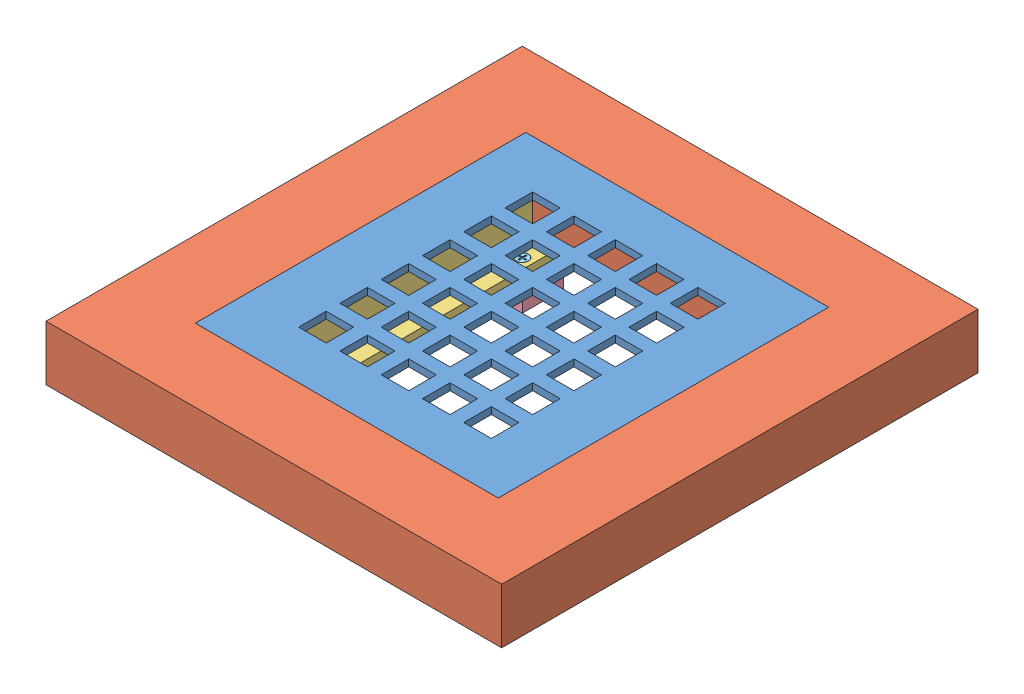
SolidWorks assembly 608.SLDASM, configuration Default (file format 11000). Lengths in mm.
Overall size (142.88 34.92 152.4).
12 component instances, 5 part files, 23 mates.
Components (placement in the parent):
- 208 Lattice Perforated Grille-1: 208 Lattice Perforated Grille.SLDPRT [Default] at origin size (139.7 3.17 152.4)
- wallORfloorORceiling-1: wallORfloorORceiling.SLDPRT [Default] at (0 -23.8125 0) x (0 0 -1) z (0 1 0) size (219.7 210.18 25.4) (hidden)
- Angle-1: Angle.SLDPRT [Default] at (-50.8 -1.5875 -57.15) size (12.7 22.23 114.3)
- Angle-2: Angle.SLDPRT [Default] at (50.8 -1.5875 57.15) x (-1 0 0) z (0 0 -1) size (12.7 22.23 114.3)
- Blocking(Supplied By Contractor)-1: Blocking(Supplied By Contractor).SLDPRT [Default] at (-52.3875 -28.575 38.1) size (38.1 9.53 19.05)
- Blocking(Supplied By Contractor)-2: Blocking(Supplied By Contractor).SLDPRT [Default] at (-52.3875 -28.575 -57.15) size (38.1 9.53 19.05)
- Blocking(Supplied By Contractor)-5: Blocking(Supplied By Contractor).SLDPRT [Default] at (52.3875 -28.575 -38.1) x (-1 0 0) z (0 0 -1) size (38.1 9.53 19.05)
- Blocking(Supplied By Contractor)-6: Blocking(Supplied By Contractor).SLDPRT [Default] at (52.3875 -28.575 57.15) x (-1 0 0) z (0 0 -1) size (38.1 9.53 19.05)
- Countersunk Screw(Provided)-1: Countersunk Screw(Provided).SLDPRT [Default] at (-42.8625 -31.9671 -47.625) size (5.55 11.33 5.55)
- Countersunk Screw(Provided)-2: Countersunk Screw(Provided).SLDPRT [Default] at (-42.8625 -31.9671 47.625) size (5.55 11.33 5.55)
- Countersunk Screw(Provided)-3: Countersunk Screw(Provided).SLDPRT [Default] at (42.8625 -31.9671 47.625) size (5.55 11.33 5.55)
- Countersunk Screw(Provided)-4: Countersunk Screw(Provided).SLDPRT [Default] at (42.8625 -31.9671 -47.625) size (5.55 11.33 5.55)
Mates (geometry in assembly coordinates):
- Coincident1: coincident: plane of 208 Lattice Perforated Grille-1 through (69.85 -1.5875 76.2) normal (0 -1 0); plane of wallORfloorORceiling-1 through (0 -1.5875 0) normal (0 1 0)
- Coincident2: coincident: plane of 208 Lattice Perforated Grille-1 through (-69.85 -1.5875 76.2) normal (-1 0 0); plane of wallORfloorORceiling-1 through (-69.85 -1.5875 -76.2) normal (1 0 0)
- Coincident3: coincident: plane of 208 Lattice Perforated Grille-1 through (0 0 76.2) normal (0 0 1); plane of wallORfloorORceiling-1 through (69.85 -1.5875 76.2) normal (0 0 -1)
- Coincident4: coincident: plane of wallORfloorORceiling-1 through (-50.8 -23.8125 -57.15) normal (1 0 0); plane of Angle-1 through (-50.8 -1.5875 57.15) normal (-1 0 0)
- Coincident5: coincident: plane of 208 Lattice Perforated Grille-1 through (69.85 -1.5875 76.2) normal (0 -1 0); plane of Angle-1 through (-47.625 -1.5875 57.15) normal (0 1 0)
- Coincident6: coincident: plane of wallORfloorORceiling-1 through (50.8 -23.8125 -57.15) normal (0 0 1); plane of Angle-1 through (-50.8 -1.5875 -57.15) normal (0 0 -1)
- Coincident8: coincident: plane of wallORfloorORceiling-1 through (50.8 -23.8125 57.15) normal (0 0 -1); plane of Angle-2 through (50.8 -1.5875 57.15) normal (0 0 1)
- Coincident9: coincident: plane of wallORfloorORceiling-1 through (0 -23.8125 0) normal (0 -1 0); plane of Angle-2 through (50.8 -23.8125 -57.15) normal (0 -1 0)
- Coincident10: coincident: plane of wallORfloorORceiling-1 through (0 -23.8125 0) normal (0 -1 0); plane of Blocking(Supplied By Contractor)-2 through (-33.3375 -23.8125 -38.1) normal (0 1 0)
- Coincident16: coincident: plane of wallORfloorORceiling-1 through (50.8 -23.8125 -57.15) normal (0 0 1); plane of Blocking(Supplied By Contractor)-2 through (-52.3875 -28.575 -57.15) normal (0 0 -1)
- Distance2: distance = 4.7625 mm: plane of Blocking(Supplied By Contractor)-2 through (-33.3375 -33.3375 -38.1) normal (1 0 0); plane of Angle-1 through (-38.1 -23.8125 57.15) normal (1 0 0)
- Coincident21: coincident: plane of Blocking(Supplied By Contractor)-1 through (-33.3375 -33.3375 57.15) normal (1 0 0); plane of Blocking(Supplied By Contractor)-2 through (-33.3375 -33.3375 -38.1) normal (1 0 0)
- Concentric1: concentric: cone of Angle-1 through (-42.8625 -20.6375 -47.625) axis (0 -1 0); cylinder of Countersunk Screw(Provided)-1 through (-42.8625 -21.5833 -47.625) axis (0 1 0) radius 1.543
- Coincident22: coincident: plane of Angle-1 through (-38.1 -20.6375 57.15) normal (0 1 0); plane of Countersunk Screw(Provided)-1 through (-43.5451 -20.6375 -47.625) normal (0 1 0)
- Concentric2: concentric: cone of Angle-1 through (-42.8625 -20.6375 47.625) axis (0 -1 0); cylinder of Countersunk Screw(Provided)-2 through (-42.8625 -21.5833 47.625) axis (0 1 0) radius 1.543
- Coincident23: coincident: plane of Angle-1 through (-38.1 -20.6375 57.15) normal (0 1 0); plane of Countersunk Screw(Provided)-2 through (-43.5451 -20.6375 47.625) normal (0 1 0)
- Coincident24: coincident: plane of Angle-2 through (38.1 -20.6375 -57.15) normal (0 1 0); plane of Countersunk Screw(Provided)-3 through (42.1799 -20.6375 47.625) normal (0 1 0)
- Concentric3: concentric: cone of Angle-2 through (42.8625 -20.6375 47.625) axis (0 -1 0); cylinder of Countersunk Screw(Provided)-3 through (42.8625 -21.5833 47.625) axis (0 1 0) radius 1.543
- Concentric4: concentric: cone of Angle-2 through (42.8625 -20.6375 -47.625) axis (0 -1 0); cylinder of Countersunk Screw(Provided)-4 through (42.8625 -21.5833 -47.625) axis (0 1 0) radius 1.543
- Coincident25: coincident: plane of Angle-2 through (38.1 -20.6375 -57.15) normal (0 1 0); plane of Countersunk Screw(Provided)-4 through (42.1799 -20.6375 -47.625) normal (0 1 0)
- Distance3: distance = 19.05 mm: plane of assembly; plane of assembly; plane of 208 Lattice Perforated Grille-1 through (69.85 -1.5875 76.2) normal (1 0 0); plane of Angle-2 through (50.8 -1.5875 -57.15) normal (1 0 0)
- Coincident28: coincident: plane of assembly; plane of assembly; plane of Angle-1 through (-50.8 -1.5875 57.15) normal (0 0 1); plane of Blocking(Supplied By Contractor)-1 through (-52.3875 -28.575 57.15) normal (0 0 1)
- Coincident29: coincident: plane of assembly; plane of assembly; plane of Angle-1 through (-50.8 -23.8125 57.15) normal (0 -1 0); plane of Blocking(Supplied By Contractor)-1 through (-33.3375 -23.8125 57.15) normal (0 1 0)
